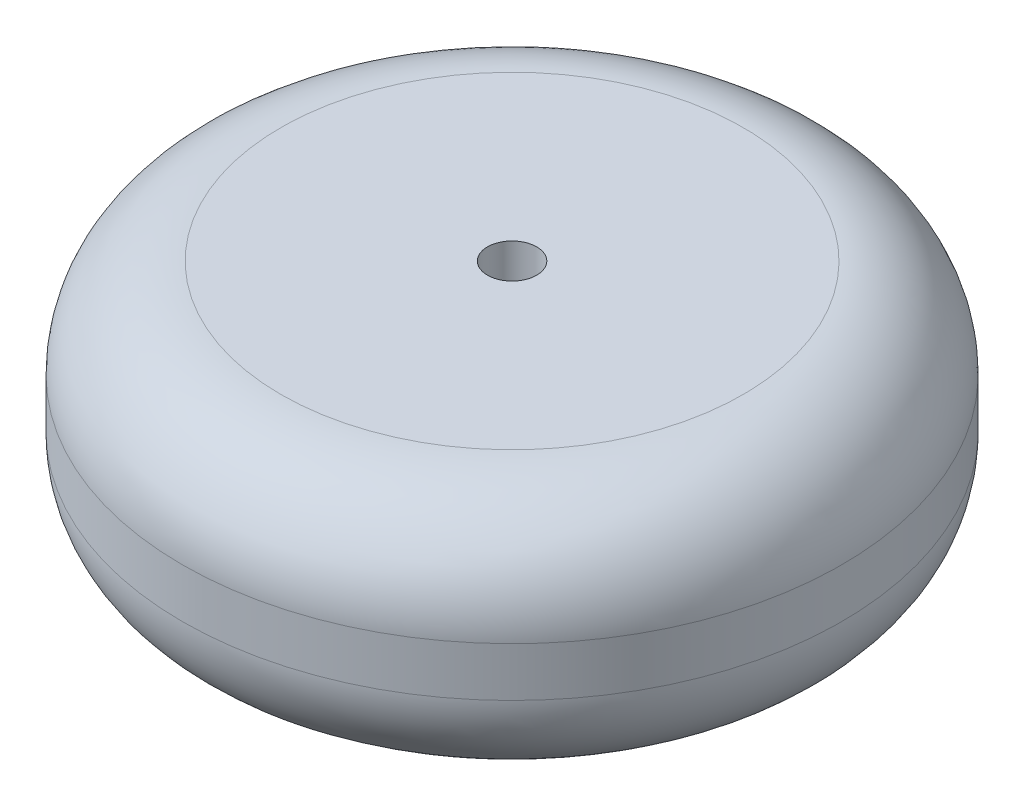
from build123d import *

# Parameters (mm, degrees)
SKETCH1_R           = 33.5
BOSS_EXTRUDE1_DEPTH = 25
FILLET1_R           = 10
SKETCH2_R           = 2.5
CUT_EXTRUDE1_DEPTH  = 8


with BuildPart() as part:
    # Sketch1 → Boss-Extrude1 (new body)
    with BuildSketch(Plane(origin=(0, 0, 0), x_dir=(1, 0, 0), z_dir=(0, 1, 0))):
        with Locations(Location((0, 0, 0), (0, 0, 270))):
            Circle(SKETCH1_R)
    extrude(amount=BOSS_EXTRUDE1_DEPTH)

    # Fillet1
    fillet1_edges = [part.edges().sort_by_distance(p)[0] for p in [
        (0, 0, -33.5),
        (0, 25, -33.5),
    ]]
    fillet(fillet1_edges, radius=FILLET1_R)

    # Sketch2 → Cut-Extrude1 (cut)
    with BuildSketch(Plane(origin=(0, 25, 0), x_dir=(1, 0, 0), z_dir=(0, 1, 0))):
        with Locations(Location((0, 0, 0), (0, 0, 270))):
            Circle(SKETCH2_R)
    extrude(amount=-CUT_EXTRUDE1_DEPTH, mode=Mode.SUBTRACT)


solid = part.part
